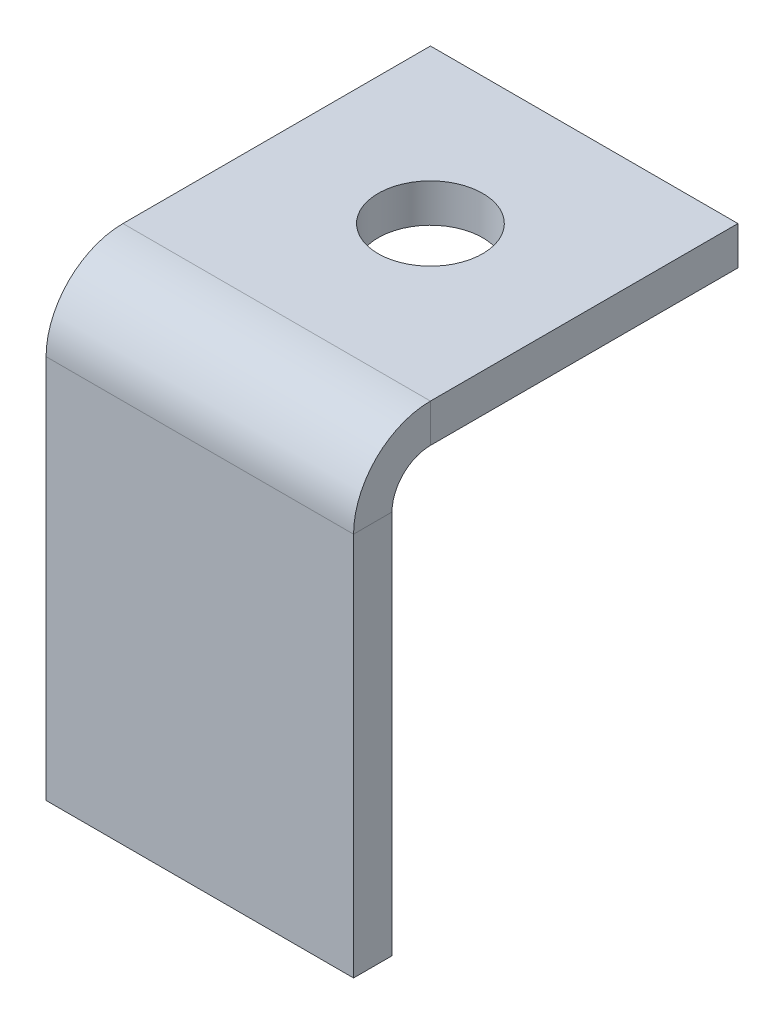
ISO-10303-21;
HEADER;
FILE_DESCRIPTION(('STEP AP214'),'2;1');
FILE_NAME('part.step','',(''),(''),'','','');
FILE_SCHEMA(('AUTOMOTIVE_DESIGN { 1 0 10303 214 1 1 1 1 }'));
ENDSEC;
DATA;
#1=APPLICATION_CONTEXT('core data for automotive mechanical design processes');
#2=APPLICATION_PROTOCOL_DEFINITION('international standard','automotive_design',2000,#1);
#3=PRODUCT_CONTEXT('',#1,'mechanical');
#4=PRODUCT('Part','Part','',(#3));
#5=PRODUCT_RELATED_PRODUCT_CATEGORY('part','',(#4));
#6=PRODUCT_DEFINITION_FORMATION('','',#4);
#7=PRODUCT_DEFINITION_CONTEXT('part definition',#1,'design');
#8=PRODUCT_DEFINITION('design','',#6,#7);
#9=PRODUCT_DEFINITION_SHAPE('','',#8);
#10=(LENGTH_UNIT() NAMED_UNIT(*) SI_UNIT(.MILLI.,.METRE.));
#11=(NAMED_UNIT(*) PLANE_ANGLE_UNIT() SI_UNIT($,.RADIAN.));
#12=(NAMED_UNIT(*) SI_UNIT($,.STERADIAN.) SOLID_ANGLE_UNIT());
#13=UNCERTAINTY_MEASURE_WITH_UNIT(LENGTH_MEASURE(1.E-05),#10,'distance_accuracy_value','');
#14=(GEOMETRIC_REPRESENTATION_CONTEXT(3) GLOBAL_UNCERTAINTY_ASSIGNED_CONTEXT((#13)) GLOBAL_UNIT_ASSIGNED_CONTEXT((#10,
#11,#12)) REPRESENTATION_CONTEXT('',''));
#15=CARTESIAN_POINT('',(0.,0.,0.));
#16=DIRECTION('',(0.,0.,1.));
#17=DIRECTION('',(1.,0.,0.));
#18=AXIS2_PLACEMENT_3D('',#15,#16,#17);
#19=CARTESIAN_POINT('',(10.,30.,-5.));
#20=DIRECTION('',(1.,0.,0.));
#21=DIRECTION('',(0.,0.,-1.));
#22=AXIS2_PLACEMENT_3D('',#19,#20,#21);
#23=PLANE('',#22);
#24=DIRECTION('',(0.,-1.,0.));
#25=VECTOR('',#24,1.);
#26=CARTESIAN_POINT('',(10.,30.,-5.));
#27=LINE('',#26,#25);
#28=CARTESIAN_POINT('',(10.,30.,-5.));
#29=VERTEX_POINT('',#28);
#30=CARTESIAN_POINT('',(10.,27.5,-5.));
#31=VERTEX_POINT('',#30);
#32=EDGE_CURVE('E11',#29,#31,#27,.T.);
#33=ORIENTED_EDGE('',*,*,#32,.F.);
#34=CARTESIAN_POINT('',(10.,25.,-5.));
#35=DIRECTION('',(1.,0.,0.));
#36=DIRECTION('',(0.,0.,-1.));
#37=AXIS2_PLACEMENT_3D('',#34,#35,#36);
#38=CIRCLE('',#37,5.);
#39=CARTESIAN_POINT('',(10.,25.,0.));
#40=VERTEX_POINT('',#39);
#41=EDGE_CURVE('E171',#40,#29,#38,.F.);
#42=ORIENTED_EDGE('',*,*,#41,.F.);
#43=DIRECTION('',(0.,0.,1.));
#44=VECTOR('',#43,1.);
#45=CARTESIAN_POINT('',(10.,25.,-2.50000000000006));
#46=LINE('',#45,#44);
#47=CARTESIAN_POINT('',(10.,25.,-2.50000000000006));
#48=VERTEX_POINT('',#47);
#49=EDGE_CURVE('E52',#48,#40,#46,.T.);
#50=ORIENTED_EDGE('',*,*,#49,.F.);
#51=CARTESIAN_POINT('',(10.,25.,-5.));
#52=DIRECTION('',(1.,0.,0.));
#53=DIRECTION('',(0.,0.,-1.));
#54=AXIS2_PLACEMENT_3D('',#51,#52,#53);
#55=CIRCLE('',#54,2.5);
#56=EDGE_CURVE('E186',#48,#31,#55,.F.);
#57=ORIENTED_EDGE('',*,*,#56,.T.);
#58=EDGE_LOOP('',(#33,#42,#50,#57));
#59=FACE_BOUND('',#58,.T.);
#60=ADVANCED_FACE('F44',(#59),#23,.T.);
#61=CARTESIAN_POINT('',(10.,25.,-2.50000000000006));
#62=DIRECTION('',(1.,0.,0.));
#63=DIRECTION('',(0.,0.,-1.));
#64=AXIS2_PLACEMENT_3D('',#61,#62,#63);
#65=PLANE('',#64);
#66=DIRECTION('',(0.,0.,-1.));
#67=VECTOR('',#66,1.);
#68=CARTESIAN_POINT('',(10.,30.,0.));
#69=LINE('',#68,#67);
#70=CARTESIAN_POINT('',(9.99999999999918,30.,-25.));
#71=VERTEX_POINT('',#70);
#72=EDGE_CURVE('E167',#29,#71,#69,.T.);
#73=ORIENTED_EDGE('',*,*,#72,.F.);
#74=ORIENTED_EDGE('',*,*,#32,.T.);
#75=DIRECTION('',(0.,0.,-1.));
#76=VECTOR('',#75,1.);
#77=CARTESIAN_POINT('',(10.,27.5,0.));
#78=LINE('',#77,#76);
#79=CARTESIAN_POINT('',(9.99999999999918,27.5,-25.));
#80=VERTEX_POINT('',#79);
#81=EDGE_CURVE('E162',#31,#80,#78,.T.);
#82=ORIENTED_EDGE('',*,*,#81,.T.);
#83=DIRECTION('',(0.,-1.,0.));
#84=VECTOR('',#83,1.);
#85=CARTESIAN_POINT('',(9.99999999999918,30.,-25.));
#86=LINE('',#85,#84);
#87=EDGE_CURVE('E114',#71,#80,#86,.T.);
#88=ORIENTED_EDGE('',*,*,#87,.F.);
#89=EDGE_LOOP('',(#73,#74,#82,#88));
#90=FACE_BOUND('',#89,.T.);
#91=ADVANCED_FACE('F238',(#90),#65,.T.);
#92=CARTESIAN_POINT('',(-10.,25.,-1.66533453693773E-12));
#93=DIRECTION('',(-1.,0.,0.));
#94=DIRECTION('',(0.,0.,1.));
#95=AXIS2_PLACEMENT_3D('',#92,#93,#94);
#96=PLANE('',#95);
#97=DIRECTION('',(0.,0.,-1.));
#98=VECTOR('',#97,1.);
#99=CARTESIAN_POINT('',(-10.,25.,-1.66533453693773E-12));
#100=LINE('',#99,#98);
#101=CARTESIAN_POINT('',(-10.,25.,-1.66533453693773E-12));
#102=VERTEX_POINT('',#101);
#103=CARTESIAN_POINT('',(-10.,25.,-2.50000000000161));
#104=VERTEX_POINT('',#103);
#105=EDGE_CURVE('E213',#102,#104,#100,.T.);
#106=ORIENTED_EDGE('',*,*,#105,.F.);
#107=CARTESIAN_POINT('',(-10.,25.,-5.00000000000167));
#108=DIRECTION('',(1.,0.,0.));
#109=DIRECTION('',(0.,0.,-1.));
#110=AXIS2_PLACEMENT_3D('',#107,#108,#109);
#111=CIRCLE('',#110,5.);
#112=CARTESIAN_POINT('',(-10.,30.,-5.00000000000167));
#113=VERTEX_POINT('',#112);
#114=EDGE_CURVE('E139',#102,#113,#111,.F.);
#115=ORIENTED_EDGE('',*,*,#114,.T.);
#116=DIRECTION('',(0.,1.,0.));
#117=VECTOR('',#116,1.);
#118=CARTESIAN_POINT('',(-10.,27.5,-5.00000000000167));
#119=LINE('',#118,#117);
#120=CARTESIAN_POINT('',(-10.,27.5,-5.00000000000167));
#121=VERTEX_POINT('',#120);
#122=EDGE_CURVE('E118',#121,#113,#119,.T.);
#123=ORIENTED_EDGE('',*,*,#122,.F.);
#124=CARTESIAN_POINT('',(-10.,25.,-5.00000000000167));
#125=DIRECTION('',(1.,0.,0.));
#126=DIRECTION('',(0.,0.,-1.));
#127=AXIS2_PLACEMENT_3D('',#124,#125,#126);
#128=CIRCLE('',#127,2.5);
#129=EDGE_CURVE('E158',#104,#121,#128,.F.);
#130=ORIENTED_EDGE('',*,*,#129,.F.);
#131=EDGE_LOOP('',(#106,#115,#123,#130));
#132=FACE_BOUND('',#131,.T.);
#133=ADVANCED_FACE('F242',(#132),#96,.T.);
#134=CARTESIAN_POINT('',(-10.,27.5,-5.00000000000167));
#135=DIRECTION('',(-1.,0.,0.));
#136=DIRECTION('',(0.,0.,1.));
#137=AXIS2_PLACEMENT_3D('',#134,#135,#136);
#138=PLANE('',#137);
#139=DIRECTION('',(0.,1.,0.));
#140=VECTOR('',#139,1.);
#141=CARTESIAN_POINT('',(-10.,0.,-1.66533453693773E-12));
#142=LINE('',#141,#140);
#143=CARTESIAN_POINT('',(-10.,0.,-1.66533453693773E-12));
#144=VERTEX_POINT('',#143);
#145=EDGE_CURVE('E146',#144,#102,#142,.T.);
#146=ORIENTED_EDGE('',*,*,#145,.T.);
#147=ORIENTED_EDGE('',*,*,#105,.T.);
#148=DIRECTION('',(0.,1.,0.));
#149=VECTOR('',#148,1.);
#150=CARTESIAN_POINT('',(-10.,0.,-2.50000000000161));
#151=LINE('',#150,#149);
#152=CARTESIAN_POINT('',(-10.,0.,-2.50000000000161));
#153=VERTEX_POINT('',#152);
#154=EDGE_CURVE('E154',#153,#104,#151,.T.);
#155=ORIENTED_EDGE('',*,*,#154,.F.);
#156=DIRECTION('',(0.,0.,1.));
#157=VECTOR('',#156,1.);
#158=CARTESIAN_POINT('',(-10.,0.,-2.50000000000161));
#159=LINE('',#158,#157);
#160=EDGE_CURVE('E150',#153,#144,#159,.T.);
#161=ORIENTED_EDGE('',*,*,#160,.T.);
#162=EDGE_LOOP('',(#146,#147,#155,#161));
#163=FACE_BOUND('',#162,.T.);
#164=ADVANCED_FACE('F244',(#163),#138,.T.);
#165=CARTESIAN_POINT('',(10.,27.5,0.));
#166=DIRECTION('',(0.,1.,0.));
#167=DIRECTION('',(0.,0.,1.));
#168=AXIS2_PLACEMENT_3D('',#165,#166,#167);
#169=PLANE('',#168);
#170=CARTESIAN_POINT('',(0.,27.5,-15.));
#171=DIRECTION('',(0.,1.,0.));
#172=DIRECTION('',(0.,0.,1.));
#173=AXIS2_PLACEMENT_3D('',#170,#171,#172);
#174=CIRCLE('',#173,3.39999999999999);
#175=CARTESIAN_POINT('',(0.,27.5,-11.6));
#176=VERTEX_POINT('',#175);
#177=EDGE_CURVE('E129',#176,#176,#174,.T.);
#178=ORIENTED_EDGE('',*,*,#177,.T.);
#179=EDGE_LOOP('',(#178));
#180=FACE_BOUND('',#179,.T.);
#181=DIRECTION('',(0.,0.,-1.));
#182=VECTOR('',#181,1.);
#183=CARTESIAN_POINT('',(-10.,27.5,-1.66533453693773E-12));
#184=LINE('',#183,#182);
#185=CARTESIAN_POINT('',(-10.0000000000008,27.5,-25.0000000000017));
#186=VERTEX_POINT('',#185);
#187=EDGE_CURVE('E123',#121,#186,#184,.T.);
#188=ORIENTED_EDGE('',*,*,#187,.T.);
#189=DIRECTION('',(-1.,0.,0.));
#190=VECTOR('',#189,1.);
#191=CARTESIAN_POINT('',(9.99999999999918,27.5,-25.));
#192=LINE('',#191,#190);
#193=EDGE_CURVE('E107',#80,#186,#192,.T.);
#194=ORIENTED_EDGE('',*,*,#193,.F.);
#195=ORIENTED_EDGE('',*,*,#81,.F.);
#196=DIRECTION('',(-1.,0.,0.));
#197=VECTOR('',#196,1.);
#198=CARTESIAN_POINT('',(10.,27.5,-5.));
#199=LINE('',#198,#197);
#200=EDGE_CURVE('E126',#31,#121,#199,.T.);
#201=ORIENTED_EDGE('',*,*,#200,.T.);
#202=EDGE_LOOP('',(#188,#194,#195,#201));
#203=FACE_BOUND('',#202,.T.);
#204=ADVANCED_FACE('F124',(#180,#203),#169,.F.);
#205=CARTESIAN_POINT('',(9.99999999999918,30.,-25.));
#206=DIRECTION('',(0.,0.,-1.));
#207=DIRECTION('',(-1.,0.,0.));
#208=AXIS2_PLACEMENT_3D('',#205,#206,#207);
#209=PLANE('',#208);
#210=DIRECTION('',(0.,-1.,0.));
#211=VECTOR('',#210,1.);
#212=CARTESIAN_POINT('',(-10.0000000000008,30.,-25.0000000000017));
#213=LINE('',#212,#211);
#214=CARTESIAN_POINT('',(-10.0000000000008,30.,-25.0000000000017));
#215=VERTEX_POINT('',#214);
#216=EDGE_CURVE('E111',#215,#186,#213,.T.);
#217=ORIENTED_EDGE('',*,*,#216,.F.);
#218=DIRECTION('',(-1.,0.,0.));
#219=VECTOR('',#218,1.);
#220=CARTESIAN_POINT('',(9.99999999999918,30.,-25.));
#221=LINE('',#220,#219);
#222=EDGE_CURVE('E119',#71,#215,#221,.T.);
#223=ORIENTED_EDGE('',*,*,#222,.F.);
#224=ORIENTED_EDGE('',*,*,#87,.T.);
#225=ORIENTED_EDGE('',*,*,#193,.T.);
#226=EDGE_LOOP('',(#217,#223,#224,#225));
#227=FACE_BOUND('',#226,.T.);
#228=ADVANCED_FACE('F109',(#227),#209,.T.);
#229=CARTESIAN_POINT('',(10.,30.,0.));
#230=DIRECTION('',(0.,1.,0.));
#231=DIRECTION('',(0.,0.,1.));
#232=AXIS2_PLACEMENT_3D('',#229,#230,#231);
#233=PLANE('',#232);
#234=CARTESIAN_POINT('',(0.,30.,-15.));
#235=DIRECTION('',(0.,1.,0.));
#236=DIRECTION('',(0.,0.,1.));
#237=AXIS2_PLACEMENT_3D('',#234,#235,#236);
#238=CIRCLE('',#237,3.39999999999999);
#239=CARTESIAN_POINT('',(0.,30.,-11.6));
#240=VERTEX_POINT('',#239);
#241=EDGE_CURVE('E413',#240,#240,#238,.T.);
#242=ORIENTED_EDGE('',*,*,#241,.F.);
#243=EDGE_LOOP('',(#242));
#244=FACE_BOUND('',#243,.T.);
#245=DIRECTION('',(0.,0.,-1.));
#246=VECTOR('',#245,1.);
#247=CARTESIAN_POINT('',(-10.,30.,-1.66533453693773E-12));
#248=LINE('',#247,#246);
#249=EDGE_CURVE('E133',#113,#215,#248,.T.);
#250=ORIENTED_EDGE('',*,*,#249,.F.);
#251=DIRECTION('',(-1.,0.,0.));
#252=VECTOR('',#251,1.);
#253=CARTESIAN_POINT('',(10.,30.,-5.));
#254=LINE('',#253,#252);
#255=EDGE_CURVE('E205',#29,#113,#254,.T.);
#256=ORIENTED_EDGE('',*,*,#255,.F.);
#257=ORIENTED_EDGE('',*,*,#72,.T.);
#258=ORIENTED_EDGE('',*,*,#222,.T.);
#259=EDGE_LOOP('',(#250,#256,#257,#258));
#260=FACE_BOUND('',#259,.T.);
#261=ADVANCED_FACE('F240',(#244,#260),#233,.T.);
#262=CARTESIAN_POINT('',(10.,25.,-5.));
#263=DIRECTION('',(-1.,0.,0.));
#264=DIRECTION('',(0.,0.,1.));
#265=AXIS2_PLACEMENT_3D('',#262,#263,#264);
#266=CYLINDRICAL_SURFACE('',#265,5.);
#267=ORIENTED_EDGE('',*,*,#114,.F.);
#268=DIRECTION('',(-1.,0.,0.));
#269=VECTOR('',#268,1.);
#270=CARTESIAN_POINT('',(10.,25.,0.));
#271=LINE('',#270,#269);
#272=EDGE_CURVE('E201',#40,#102,#271,.T.);
#273=ORIENTED_EDGE('',*,*,#272,.F.);
#274=ORIENTED_EDGE('',*,*,#41,.T.);
#275=ORIENTED_EDGE('',*,*,#255,.T.);
#276=EDGE_LOOP('',(#267,#273,#274,#275));
#277=FACE_BOUND('',#276,.T.);
#278=ADVANCED_FACE('F223',(#277),#266,.T.);
#279=CARTESIAN_POINT('',(10.,0.,0.));
#280=DIRECTION('',(0.,0.,1.));
#281=DIRECTION('',(1.,0.,0.));
#282=AXIS2_PLACEMENT_3D('',#279,#280,#281);
#283=PLANE('',#282);
#284=ORIENTED_EDGE('',*,*,#145,.F.);
#285=DIRECTION('',(-1.,0.,0.));
#286=VECTOR('',#285,1.);
#287=CARTESIAN_POINT('',(10.,0.,0.));
#288=LINE('',#287,#286);
#289=CARTESIAN_POINT('',(10.,0.,0.));
#290=VERTEX_POINT('',#289);
#291=EDGE_CURVE('E198',#290,#144,#288,.T.);
#292=ORIENTED_EDGE('',*,*,#291,.F.);
#293=DIRECTION('',(0.,1.,0.));
#294=VECTOR('',#293,1.);
#295=CARTESIAN_POINT('',(10.,0.,0.));
#296=LINE('',#295,#294);
#297=EDGE_CURVE('E175',#290,#40,#296,.T.);
#298=ORIENTED_EDGE('',*,*,#297,.T.);
#299=ORIENTED_EDGE('',*,*,#272,.T.);
#300=EDGE_LOOP('',(#284,#292,#298,#299));
#301=FACE_BOUND('',#300,.T.);
#302=ADVANCED_FACE('F227',(#301),#283,.T.);
#303=CARTESIAN_POINT('',(10.,0.,-2.50000000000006));
#304=DIRECTION('',(0.,-1.,0.));
#305=DIRECTION('',(0.,0.,-1.));
#306=AXIS2_PLACEMENT_3D('',#303,#304,#305);
#307=PLANE('',#306);
#308=ORIENTED_EDGE('',*,*,#160,.F.);
#309=DIRECTION('',(-1.,0.,0.));
#310=VECTOR('',#309,1.);
#311=CARTESIAN_POINT('',(10.,0.,-2.50000000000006));
#312=LINE('',#311,#310);
#313=CARTESIAN_POINT('',(10.,0.,-2.50000000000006));
#314=VERTEX_POINT('',#313);
#315=EDGE_CURVE('E195',#314,#153,#312,.T.);
#316=ORIENTED_EDGE('',*,*,#315,.F.);
#317=DIRECTION('',(0.,0.,1.));
#318=VECTOR('',#317,1.);
#319=CARTESIAN_POINT('',(10.,0.,-2.50000000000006));
#320=LINE('',#319,#318);
#321=EDGE_CURVE('E179',#314,#290,#320,.T.);
#322=ORIENTED_EDGE('',*,*,#321,.T.);
#323=ORIENTED_EDGE('',*,*,#291,.T.);
#324=EDGE_LOOP('',(#308,#316,#322,#323));
#325=FACE_BOUND('',#324,.T.);
#326=ADVANCED_FACE('F230',(#325),#307,.T.);
#327=CARTESIAN_POINT('',(10.,0.,-2.50000000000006));
#328=DIRECTION('',(0.,0.,1.));
#329=DIRECTION('',(1.,0.,0.));
#330=AXIS2_PLACEMENT_3D('',#327,#328,#329);
#331=PLANE('',#330);
#332=ORIENTED_EDGE('',*,*,#154,.T.);
#333=DIRECTION('',(-1.,0.,0.));
#334=VECTOR('',#333,1.);
#335=CARTESIAN_POINT('',(10.,25.,-2.50000000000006));
#336=LINE('',#335,#334);
#337=EDGE_CURVE('E191',#48,#104,#336,.T.);
#338=ORIENTED_EDGE('',*,*,#337,.F.);
#339=DIRECTION('',(0.,1.,0.));
#340=VECTOR('',#339,1.);
#341=CARTESIAN_POINT('',(10.,0.,-2.50000000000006));
#342=LINE('',#341,#340);
#343=EDGE_CURVE('E183',#314,#48,#342,.T.);
#344=ORIENTED_EDGE('',*,*,#343,.F.);
#345=ORIENTED_EDGE('',*,*,#315,.T.);
#346=EDGE_LOOP('',(#332,#338,#344,#345));
#347=FACE_BOUND('',#346,.T.);
#348=ADVANCED_FACE('F233',(#347),#331,.F.);
#349=CARTESIAN_POINT('',(10.,25.,-5.));
#350=DIRECTION('',(-1.,0.,0.));
#351=DIRECTION('',(0.,0.,1.));
#352=AXIS2_PLACEMENT_3D('',#349,#350,#351);
#353=CYLINDRICAL_SURFACE('',#352,2.5);
#354=ORIENTED_EDGE('',*,*,#129,.T.);
#355=ORIENTED_EDGE('',*,*,#200,.F.);
#356=ORIENTED_EDGE('',*,*,#56,.F.);
#357=ORIENTED_EDGE('',*,*,#337,.T.);
#358=EDGE_LOOP('',(#354,#355,#356,#357));
#359=FACE_BOUND('',#358,.T.);
#360=ADVANCED_FACE('F237',(#359),#353,.F.);
#361=CARTESIAN_POINT('',(10.,25.,-5.));
#362=DIRECTION('',(1.,0.,0.));
#363=DIRECTION('',(0.,0.,-1.));
#364=AXIS2_PLACEMENT_3D('',#361,#362,#363);
#365=PLANE('',#364);
#366=ORIENTED_EDGE('',*,*,#343,.T.);
#367=ORIENTED_EDGE('',*,*,#49,.T.);
#368=ORIENTED_EDGE('',*,*,#297,.F.);
#369=ORIENTED_EDGE('',*,*,#321,.F.);
#370=EDGE_LOOP('',(#366,#367,#368,#369));
#371=FACE_BOUND('',#370,.T.);
#372=ADVANCED_FACE('F217',(#371),#365,.T.);
#373=CARTESIAN_POINT('',(-10.,25.,-5.00000000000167));
#374=DIRECTION('',(1.,0.,0.));
#375=DIRECTION('',(0.,0.,-1.));
#376=AXIS2_PLACEMENT_3D('',#373,#374,#375);
#377=PLANE('',#376);
#378=ORIENTED_EDGE('',*,*,#187,.F.);
#379=ORIENTED_EDGE('',*,*,#122,.T.);
#380=ORIENTED_EDGE('',*,*,#249,.T.);
#381=ORIENTED_EDGE('',*,*,#216,.T.);
#382=EDGE_LOOP('',(#378,#379,#380,#381));
#383=FACE_BOUND('',#382,.T.);
#384=ADVANCED_FACE('F131',(#383),#377,.F.);
#385=CARTESIAN_POINT('',(0.,30.,-15.));
#386=DIRECTION('',(0.,1.,0.));
#387=DIRECTION('',(0.,0.,1.));
#388=AXIS2_PLACEMENT_3D('',#385,#386,#387);
#389=CYLINDRICAL_SURFACE('',#388,3.39999999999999);
#390=ORIENTED_EDGE('',*,*,#241,.T.);
#391=EDGE_LOOP('',(#390));
#392=FACE_BOUND('',#391,.T.);
#393=ORIENTED_EDGE('',*,*,#177,.F.);
#394=EDGE_LOOP('',(#393));
#395=FACE_BOUND('',#394,.T.);
#396=ADVANCED_FACE('F337',(#392,#395),#389,.F.);
#397=CLOSED_SHELL('',(#60,#91,#133,#164,#204,#228,#261,#278,#302,#326,#348,#360,#372,#384,#396));
#398=MANIFOLD_SOLID_BREP('B2',#397);
#399=ADVANCED_BREP_SHAPE_REPRESENTATION('',(#18,#398),#14);
#400=SHAPE_DEFINITION_REPRESENTATION(#9,#399);
ENDSEC;
END-ISO-10303-21;
